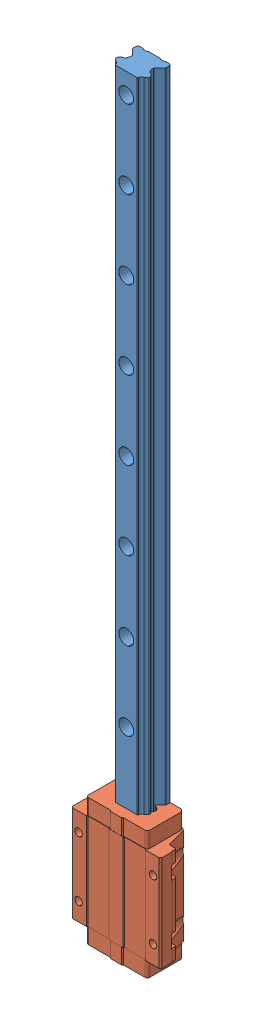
SolidWorks assembly HXW25HA1R1000ZOC+E22020.step.sldasm, configuration 默认 (file format 13000). Lengths in mm.
Overall size (120 1028.3 52).
2 component instances, 2 part files, 0 mates.
Components (placement in the parent):
- HLR25R1000 E=20-1: HLR25R1000 E=20.SLDPRT [默认] at origin size (45 1000 38)
- HLW25HC-1: HLW25HC.SLDPRT [默认] at (0 57.3 14) size (120 171.2 50.5)
